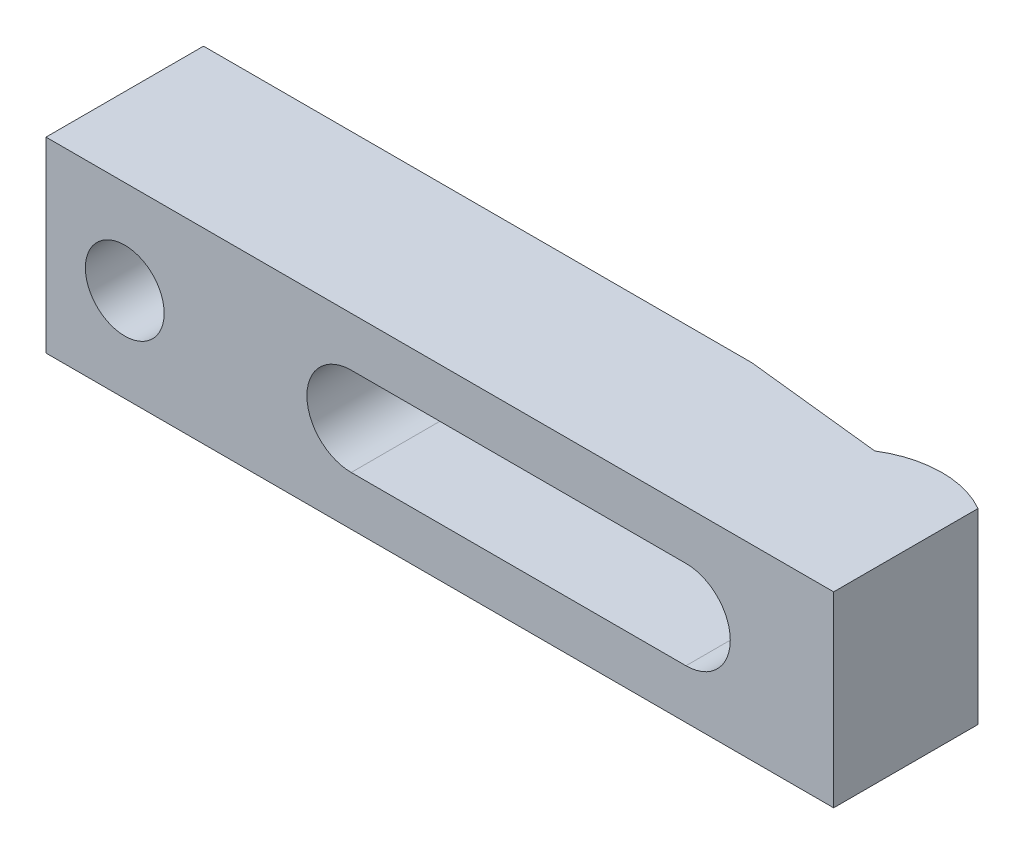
ISO-10303-21;
HEADER;
FILE_DESCRIPTION(('STEP AP214'),'2;1');
FILE_NAME('part.step','',(''),(''),'','','');
FILE_SCHEMA(('AUTOMOTIVE_DESIGN { 1 0 10303 214 1 1 1 1 }'));
ENDSEC;
DATA;
#1=APPLICATION_CONTEXT('core data for automotive mechanical design processes');
#2=APPLICATION_PROTOCOL_DEFINITION('international standard','automotive_design',2000,#1);
#3=PRODUCT_CONTEXT('',#1,'mechanical');
#4=PRODUCT('Part','Part','',(#3));
#5=PRODUCT_RELATED_PRODUCT_CATEGORY('part','',(#4));
#6=PRODUCT_DEFINITION_FORMATION('','',#4);
#7=PRODUCT_DEFINITION_CONTEXT('part definition',#1,'design');
#8=PRODUCT_DEFINITION('design','',#6,#7);
#9=PRODUCT_DEFINITION_SHAPE('','',#8);
#10=(LENGTH_UNIT() NAMED_UNIT(*) SI_UNIT(.MILLI.,.METRE.));
#11=(NAMED_UNIT(*) PLANE_ANGLE_UNIT() SI_UNIT($,.RADIAN.));
#12=(NAMED_UNIT(*) SI_UNIT($,.STERADIAN.) SOLID_ANGLE_UNIT());
#13=UNCERTAINTY_MEASURE_WITH_UNIT(LENGTH_MEASURE(1.E-05),#10,'distance_accuracy_value','');
#14=(GEOMETRIC_REPRESENTATION_CONTEXT(3) GLOBAL_UNCERTAINTY_ASSIGNED_CONTEXT((#13)) GLOBAL_UNIT_ASSIGNED_CONTEXT((#10,
#11,#12)) REPRESENTATION_CONTEXT('',''));
#15=CARTESIAN_POINT('',(0.,0.,0.));
#16=DIRECTION('',(0.,0.,1.));
#17=DIRECTION('',(1.,0.,0.));
#18=AXIS2_PLACEMENT_3D('',#15,#16,#17);
#19=CARTESIAN_POINT('',(-65.,9.5,0.));
#20=DIRECTION('',(0.,0.,-1.));
#21=DIRECTION('',(-1.,0.,0.));
#22=AXIS2_PLACEMENT_3D('',#19,#20,#21);
#23=PLANE('',#22);
#24=DIRECTION('',(1.,0.,0.));
#25=VECTOR('',#24,1.);
#26=CARTESIAN_POINT('',(-34.,4.5,0.));
#27=LINE('',#26,#25);
#28=CARTESIAN_POINT('',(-65.,4.5,0.));
#29=VERTEX_POINT('',#28);
#30=CARTESIAN_POINT('',(-9.3,4.5,0.));
#31=VERTEX_POINT('',#30);
#32=EDGE_CURVE('E122',#29,#31,#27,.T.);
#33=ORIENTED_EDGE('',*,*,#32,.F.);
#34=DIRECTION('',(0.,-1.,0.));
#35=VECTOR('',#34,1.);
#36=CARTESIAN_POINT('',(-65.,9.5,0.));
#37=LINE('',#36,#35);
#38=CARTESIAN_POINT('',(-65.,9.5,0.));
#39=VERTEX_POINT('',#38);
#40=EDGE_CURVE('E139',#39,#29,#37,.T.);
#41=ORIENTED_EDGE('',*,*,#40,.F.);
#42=DIRECTION('',(1.,0.,0.));
#43=VECTOR('',#42,1.);
#44=CARTESIAN_POINT('',(-65.,9.5,0.));
#45=LINE('',#44,#43);
#46=CARTESIAN_POINT('',(-9.3,9.5,0.));
#47=VERTEX_POINT('',#46);
#48=EDGE_CURVE('E196',#39,#47,#45,.T.);
#49=ORIENTED_EDGE('',*,*,#48,.T.);
#50=DIRECTION('',(0.,-1.,0.));
#51=VECTOR('',#50,1.);
#52=CARTESIAN_POINT('',(-9.3,9.5,0.));
#53=LINE('',#52,#51);
#54=EDGE_CURVE('E147',#47,#31,#53,.T.);
#55=ORIENTED_EDGE('',*,*,#54,.T.);
#56=EDGE_LOOP('',(#33,#41,#49,#55));
#57=FACE_BOUND('',#56,.T.);
#58=ADVANCED_FACE('F14',(#57),#23,.T.);
#59=CARTESIAN_POINT('',(-65.,9.5,16.));
#60=DIRECTION('',(-1.,0.,0.));
#61=DIRECTION('',(0.,0.,1.));
#62=AXIS2_PLACEMENT_3D('',#59,#60,#61);
#63=PLANE('',#62);
#64=ORIENTED_EDGE('',*,*,#40,.T.);
#65=DIRECTION('',(0.,0.,1.));
#66=VECTOR('',#65,1.);
#67=CARTESIAN_POINT('',(-65.,4.5,16.));
#68=LINE('',#67,#66);
#69=CARTESIAN_POINT('',(-65.,4.5,5.));
#70=VERTEX_POINT('',#69);
#71=EDGE_CURVE('E133',#29,#70,#68,.T.);
#72=ORIENTED_EDGE('',*,*,#71,.T.);
#73=DIRECTION('',(0.,-1.,0.));
#74=VECTOR('',#73,1.);
#75=CARTESIAN_POINT('',(-65.,9.5,5.));
#76=LINE('',#75,#74);
#77=CARTESIAN_POINT('',(-65.,-4.5,5.));
#78=VERTEX_POINT('',#77);
#79=EDGE_CURVE('E132',#70,#78,#76,.T.);
#80=ORIENTED_EDGE('',*,*,#79,.T.);
#81=DIRECTION('',(0.,0.,1.));
#82=VECTOR('',#81,1.);
#83=CARTESIAN_POINT('',(-65.,-4.5,16.));
#84=LINE('',#83,#82);
#85=CARTESIAN_POINT('',(-65.,-4.5,0.));
#86=VERTEX_POINT('',#85);
#87=EDGE_CURVE('E115',#86,#78,#84,.T.);
#88=ORIENTED_EDGE('',*,*,#87,.F.);
#89=CARTESIAN_POINT('',(-65.,-9.5,0.));
#90=VERTEX_POINT('',#89);
#91=EDGE_CURVE('E129',#86,#90,#37,.T.);
#92=ORIENTED_EDGE('',*,*,#91,.T.);
#93=DIRECTION('',(0.,0.,-1.));
#94=VECTOR('',#93,1.);
#95=CARTESIAN_POINT('',(-65.,-9.5,16.));
#96=LINE('',#95,#94);
#97=CARTESIAN_POINT('',(-65.,-9.5,16.));
#98=VERTEX_POINT('',#97);
#99=EDGE_CURVE('E169',#98,#90,#96,.T.);
#100=ORIENTED_EDGE('',*,*,#99,.F.);
#101=DIRECTION('',(0.,-1.,0.));
#102=VECTOR('',#101,1.);
#103=CARTESIAN_POINT('',(-65.,9.5,16.));
#104=LINE('',#103,#102);
#105=CARTESIAN_POINT('',(-65.,9.5,16.));
#106=VERTEX_POINT('',#105);
#107=EDGE_CURVE('E140',#106,#98,#104,.T.);
#108=ORIENTED_EDGE('',*,*,#107,.F.);
#109=DIRECTION('',(0.,0.,-1.));
#110=VECTOR('',#109,1.);
#111=CARTESIAN_POINT('',(-65.,9.5,16.));
#112=LINE('',#111,#110);
#113=EDGE_CURVE('E179',#106,#39,#112,.T.);
#114=ORIENTED_EDGE('',*,*,#113,.T.);
#115=EDGE_LOOP('',(#64,#72,#80,#88,#92,#100,#108,#114));
#116=FACE_BOUND('',#115,.T.);
#117=ADVANCED_FACE('F127',(#116),#63,.T.);
#118=CARTESIAN_POINT('',(-34.,0.,16.));
#119=DIRECTION('',(0.,0.,-1.));
#120=DIRECTION('',(-1.,0.,0.));
#121=AXIS2_PLACEMENT_3D('',#118,#119,#120);
#122=CYLINDRICAL_SURFACE('',#121,4.5);
#123=DIRECTION('',(0.,0.,-1.));
#124=VECTOR('',#123,1.);
#125=CARTESIAN_POINT('',(-34.,-4.5,16.));
#126=LINE('',#125,#124);
#127=CARTESIAN_POINT('',(-34.,-4.5,16.));
#128=VERTEX_POINT('',#127);
#129=CARTESIAN_POINT('',(-34.,-4.5,5.));
#130=VERTEX_POINT('',#129);
#131=EDGE_CURVE('E229',#128,#130,#126,.T.);
#132=ORIENTED_EDGE('',*,*,#131,.T.);
#133=CARTESIAN_POINT('',(-34.,0.,5.));
#134=DIRECTION('',(0.,0.,-1.));
#135=DIRECTION('',(-1.,0.,0.));
#136=AXIS2_PLACEMENT_3D('',#133,#134,#135);
#137=CIRCLE('',#136,4.5);
#138=CARTESIAN_POINT('',(-34.,4.5,5.));
#139=VERTEX_POINT('',#138);
#140=EDGE_CURVE('E245',#130,#139,#137,.T.);
#141=ORIENTED_EDGE('',*,*,#140,.T.);
#142=DIRECTION('',(0.,0.,-1.));
#143=VECTOR('',#142,1.);
#144=CARTESIAN_POINT('',(-34.,4.5,16.));
#145=LINE('',#144,#143);
#146=CARTESIAN_POINT('',(-34.,4.5,16.));
#147=VERTEX_POINT('',#146);
#148=EDGE_CURVE('E231',#147,#139,#145,.T.);
#149=ORIENTED_EDGE('',*,*,#148,.F.);
#150=CARTESIAN_POINT('',(-34.,0.,16.));
#151=DIRECTION('',(0.,0.,1.));
#152=DIRECTION('',(1.,0.,0.));
#153=AXIS2_PLACEMENT_3D('',#150,#151,#152);
#154=CIRCLE('',#153,4.5);
#155=EDGE_CURVE('E38',#147,#128,#154,.T.);
#156=ORIENTED_EDGE('',*,*,#155,.T.);
#157=EDGE_LOOP('',(#132,#141,#149,#156));
#158=FACE_BOUND('',#157,.T.);
#159=ADVANCED_FACE('F244',(#158),#122,.F.);
#160=CARTESIAN_POINT('',(-57.,0.,16.));
#161=DIRECTION('',(0.,0.,-1.));
#162=DIRECTION('',(-1.,0.,0.));
#163=AXIS2_PLACEMENT_3D('',#160,#161,#162);
#164=CYLINDRICAL_SURFACE('',#163,4.);
#165=CARTESIAN_POINT('',(-57.,0.,16.));
#166=DIRECTION('',(0.,0.,1.));
#167=DIRECTION('',(1.,0.,0.));
#168=AXIS2_PLACEMENT_3D('',#165,#166,#167);
#169=CIRCLE('',#168,4.);
#170=CARTESIAN_POINT('',(-53.,0.,16.));
#171=VERTEX_POINT('',#170);
#172=EDGE_CURVE('E209',#171,#171,#169,.T.);
#173=ORIENTED_EDGE('',*,*,#172,.T.);
#174=EDGE_LOOP('',(#173));
#175=FACE_BOUND('',#174,.T.);
#176=CARTESIAN_POINT('',(-57.,0.,5.));
#177=DIRECTION('',(0.,0.,-1.));
#178=DIRECTION('',(-1.,0.,0.));
#179=AXIS2_PLACEMENT_3D('',#176,#177,#178);
#180=CIRCLE('',#179,4.);
#181=CARTESIAN_POINT('',(-61.,0.,5.));
#182=VERTEX_POINT('',#181);
#183=EDGE_CURVE('E18',#182,#182,#180,.T.);
#184=ORIENTED_EDGE('',*,*,#183,.T.);
#185=EDGE_LOOP('',(#184));
#186=FACE_BOUND('',#185,.T.);
#187=ADVANCED_FACE('F275',(#175,#186),#164,.F.);
#188=CARTESIAN_POINT('',(15.,9.5,16.));
#189=DIRECTION('',(0.,0.,1.));
#190=DIRECTION('',(1.,0.,0.));
#191=AXIS2_PLACEMENT_3D('',#188,#189,#190);
#192=PLANE('',#191);
#193=DIRECTION('',(1.,0.,0.));
#194=VECTOR('',#193,1.);
#195=CARTESIAN_POINT('',(-34.,4.5,16.));
#196=LINE('',#195,#194);
#197=CARTESIAN_POINT('',(0.,4.5,16.));
#198=VERTEX_POINT('',#197);
#199=EDGE_CURVE('E223',#147,#198,#196,.T.);
#200=ORIENTED_EDGE('',*,*,#199,.T.);
#201=CARTESIAN_POINT('',(0.,0.,16.));
#202=DIRECTION('',(0.,0.,1.));
#203=DIRECTION('',(1.,0.,0.));
#204=AXIS2_PLACEMENT_3D('',#201,#202,#203);
#205=CIRCLE('',#204,4.5);
#206=CARTESIAN_POINT('',(0.,-4.5,16.));
#207=VERTEX_POINT('',#206);
#208=EDGE_CURVE('E121',#207,#198,#205,.T.);
#209=ORIENTED_EDGE('',*,*,#208,.F.);
#210=DIRECTION('',(-1.,0.,0.));
#211=VECTOR('',#210,1.);
#212=CARTESIAN_POINT('',(0.,-4.5,16.));
#213=LINE('',#212,#211);
#214=EDGE_CURVE('E218',#207,#128,#213,.T.);
#215=ORIENTED_EDGE('',*,*,#214,.T.);
#216=ORIENTED_EDGE('',*,*,#155,.F.);
#217=EDGE_LOOP('',(#200,#209,#215,#216));
#218=FACE_BOUND('',#217,.T.);
#219=DIRECTION('',(0.,-1.,0.));
#220=VECTOR('',#219,1.);
#221=CARTESIAN_POINT('',(15.,9.5,16.));
#222=LINE('',#221,#220);
#223=CARTESIAN_POINT('',(15.,9.5,16.));
#224=VERTEX_POINT('',#223);
#225=CARTESIAN_POINT('',(15.,-9.5,16.));
#226=VERTEX_POINT('',#225);
#227=EDGE_CURVE('E23',#224,#226,#222,.T.);
#228=ORIENTED_EDGE('',*,*,#227,.F.);
#229=DIRECTION('',(-1.,0.,0.));
#230=VECTOR('',#229,1.);
#231=CARTESIAN_POINT('',(15.,9.5,16.));
#232=LINE('',#231,#230);
#233=EDGE_CURVE('E177',#224,#106,#232,.T.);
#234=ORIENTED_EDGE('',*,*,#233,.T.);
#235=ORIENTED_EDGE('',*,*,#107,.T.);
#236=DIRECTION('',(-1.,0.,0.));
#237=VECTOR('',#236,1.);
#238=CARTESIAN_POINT('',(15.,-9.5,16.));
#239=LINE('',#238,#237);
#240=EDGE_CURVE('E165',#226,#98,#239,.T.);
#241=ORIENTED_EDGE('',*,*,#240,.F.);
#242=EDGE_LOOP('',(#228,#234,#235,#241));
#243=FACE_BOUND('',#242,.T.);
#244=ORIENTED_EDGE('',*,*,#172,.F.);
#245=EDGE_LOOP('',(#244));
#246=FACE_BOUND('',#245,.T.);
#247=ADVANCED_FACE('F166',(#218,#243,#246),#192,.T.);
#248=ORIENTED_EDGE('',*,*,#91,.F.);
#249=DIRECTION('',(-1.,0.,0.));
#250=VECTOR('',#249,1.);
#251=CARTESIAN_POINT('',(0.,-4.5,0.));
#252=LINE('',#251,#250);
#253=CARTESIAN_POINT('',(-9.3,-4.5,0.));
#254=VERTEX_POINT('',#253);
#255=EDGE_CURVE('E110',#254,#86,#252,.T.);
#256=ORIENTED_EDGE('',*,*,#255,.F.);
#257=CARTESIAN_POINT('',(-9.3,-9.5,0.));
#258=VERTEX_POINT('',#257);
#259=EDGE_CURVE('E142',#254,#258,#53,.T.);
#260=ORIENTED_EDGE('',*,*,#259,.T.);
#261=DIRECTION('',(1.,0.,0.));
#262=VECTOR('',#261,1.);
#263=CARTESIAN_POINT('',(-65.,-9.5,0.));
#264=LINE('',#263,#262);
#265=EDGE_CURVE('E138',#90,#258,#264,.T.);
#266=ORIENTED_EDGE('',*,*,#265,.F.);
#267=EDGE_LOOP('',(#248,#256,#260,#266));
#268=FACE_BOUND('',#267,.T.);
#269=ADVANCED_FACE('F136',(#268),#23,.T.);
#270=CARTESIAN_POINT('',(15.,9.5,16.));
#271=DIRECTION('',(-1.,0.,0.));
#272=DIRECTION('',(0.,0.,1.));
#273=AXIS2_PLACEMENT_3D('',#270,#271,#272);
#274=PLANE('',#273);
#275=DIRECTION('',(0.,-1.,0.));
#276=VECTOR('',#275,1.);
#277=CARTESIAN_POINT('',(15.,9.5,1.33974596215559));
#278=LINE('',#277,#276);
#279=CARTESIAN_POINT('',(15.,9.5,1.33974596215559));
#280=VERTEX_POINT('',#279);
#281=CARTESIAN_POINT('',(15.,-9.5,1.33974596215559));
#282=VERTEX_POINT('',#281);
#283=EDGE_CURVE('E152',#280,#282,#278,.T.);
#284=ORIENTED_EDGE('',*,*,#283,.F.);
#285=DIRECTION('',(0.,0.,-1.));
#286=VECTOR('',#285,1.);
#287=CARTESIAN_POINT('',(15.,9.5,16.));
#288=LINE('',#287,#286);
#289=EDGE_CURVE('E143',#224,#280,#288,.T.);
#290=ORIENTED_EDGE('',*,*,#289,.F.);
#291=ORIENTED_EDGE('',*,*,#227,.T.);
#292=DIRECTION('',(0.,0.,-1.));
#293=VECTOR('',#292,1.);
#294=CARTESIAN_POINT('',(15.,-9.5,16.));
#295=LINE('',#294,#293);
#296=EDGE_CURVE('E159',#226,#282,#295,.T.);
#297=ORIENTED_EDGE('',*,*,#296,.T.);
#298=EDGE_LOOP('',(#284,#290,#291,#297));
#299=FACE_BOUND('',#298,.T.);
#300=ADVANCED_FACE('F16',(#299),#274,.F.);
#301=CARTESIAN_POINT('',(10.,9.5,10.));
#302=DIRECTION('',(0.,-1.,0.));
#303=DIRECTION('',(0.,0.,-1.));
#304=AXIS2_PLACEMENT_3D('',#301,#302,#303);
#305=CYLINDRICAL_SURFACE('',#304,10.);
#306=DIRECTION('',(0.,-1.,0.));
#307=VECTOR('',#306,1.);
#308=CARTESIAN_POINT('',(4.7,9.5,1.52002358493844));
#309=LINE('',#308,#307);
#310=CARTESIAN_POINT('',(4.7,9.5,1.52002358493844));
#311=VERTEX_POINT('',#310);
#312=CARTESIAN_POINT('',(4.7,-9.5,1.52002358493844));
#313=VERTEX_POINT('',#312);
#314=EDGE_CURVE('E150',#311,#313,#309,.T.);
#315=ORIENTED_EDGE('',*,*,#314,.F.);
#316=CARTESIAN_POINT('',(10.,9.5,10.));
#317=DIRECTION('',(0.,1.,0.));
#318=DIRECTION('',(0.,0.,1.));
#319=AXIS2_PLACEMENT_3D('',#316,#317,#318);
#320=CIRCLE('',#319,10.);
#321=EDGE_CURVE('E190',#280,#311,#320,.T.);
#322=ORIENTED_EDGE('',*,*,#321,.F.);
#323=ORIENTED_EDGE('',*,*,#283,.T.);
#324=CARTESIAN_POINT('',(10.,-9.5,10.));
#325=DIRECTION('',(0.,1.,0.));
#326=DIRECTION('',(0.,0.,1.));
#327=AXIS2_PLACEMENT_3D('',#324,#325,#326);
#328=CIRCLE('',#327,10.);
#329=EDGE_CURVE('E176',#282,#313,#328,.T.);
#330=ORIENTED_EDGE('',*,*,#329,.T.);
#331=EDGE_LOOP('',(#315,#322,#323,#330));
#332=FACE_BOUND('',#331,.T.);
#333=ADVANCED_FACE('F274',(#332),#305,.T.);
#334=CARTESIAN_POINT('',(4.7,9.5,1.52002358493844));
#335=DIRECTION('',(-0.107938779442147,0.,0.994157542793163));
#336=DIRECTION('',(0.994157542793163,0.,0.107938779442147));
#337=AXIS2_PLACEMENT_3D('',#334,#335,#336);
#338=PLANE('',#337);
#339=CARTESIAN_POINT('',(0.,0.,1.00972995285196));
#340=DIRECTION('',(-0.107938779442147,0.,0.994157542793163));
#341=DIRECTION('',(-0.994157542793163,0.,-0.107938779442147));
#342=AXIS2_PLACEMENT_3D('',#339,#340,#341);
#343=ELLIPSE('',#342,4.52644556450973,4.5);
#344=CARTESIAN_POINT('',(0.,4.5,1.00972995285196));
#345=VERTEX_POINT('',#344);
#346=CARTESIAN_POINT('',(0.,-4.5,1.00972995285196));
#347=VERTEX_POINT('',#346);
#348=EDGE_CURVE('E9',#345,#347,#343,.F.);
#349=ORIENTED_EDGE('',*,*,#348,.F.);
#350=DIRECTION('',(-0.994157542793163,0.,-0.107938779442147));
#351=VECTOR('',#350,1.);
#352=CARTESIAN_POINT('',(4.7,4.5,1.52002358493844));
#353=LINE('',#352,#351);
#354=EDGE_CURVE('E170',#345,#31,#353,.T.);
#355=ORIENTED_EDGE('',*,*,#354,.T.);
#356=ORIENTED_EDGE('',*,*,#54,.F.);
#357=DIRECTION('',(-0.994157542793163,0.,-0.107938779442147));
#358=VECTOR('',#357,1.);
#359=CARTESIAN_POINT('',(4.7,9.5,1.52002358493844));
#360=LINE('',#359,#358);
#361=EDGE_CURVE('E193',#311,#47,#360,.T.);
#362=ORIENTED_EDGE('',*,*,#361,.F.);
#363=ORIENTED_EDGE('',*,*,#314,.T.);
#364=DIRECTION('',(-0.994157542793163,0.,-0.107938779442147));
#365=VECTOR('',#364,1.);
#366=CARTESIAN_POINT('',(4.7,-9.5,1.52002358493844));
#367=LINE('',#366,#365);
#368=EDGE_CURVE('E180',#313,#258,#367,.T.);
#369=ORIENTED_EDGE('',*,*,#368,.T.);
#370=ORIENTED_EDGE('',*,*,#259,.F.);
#371=DIRECTION('',(0.994157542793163,0.,0.107938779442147));
#372=VECTOR('',#371,1.);
#373=CARTESIAN_POINT('',(4.7,-4.5,1.52002358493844));
#374=LINE('',#373,#372);
#375=EDGE_CURVE('E117',#254,#347,#374,.T.);
#376=ORIENTED_EDGE('',*,*,#375,.T.);
#377=EDGE_LOOP('',(#349,#355,#356,#362,#363,#369,#370,#376));
#378=FACE_BOUND('',#377,.T.);
#379=ADVANCED_FACE('F237',(#378),#338,.F.);
#380=CARTESIAN_POINT('',(10.,9.5,10.));
#381=DIRECTION('',(0.,1.,0.));
#382=DIRECTION('',(0.,0.,1.));
#383=AXIS2_PLACEMENT_3D('',#380,#381,#382);
#384=PLANE('',#383);
#385=ORIENTED_EDGE('',*,*,#233,.F.);
#386=ORIENTED_EDGE('',*,*,#289,.T.);
#387=ORIENTED_EDGE('',*,*,#321,.T.);
#388=ORIENTED_EDGE('',*,*,#361,.T.);
#389=ORIENTED_EDGE('',*,*,#48,.F.);
#390=ORIENTED_EDGE('',*,*,#113,.F.);
#391=EDGE_LOOP('',(#385,#386,#387,#388,#389,#390));
#392=FACE_BOUND('',#391,.T.);
#393=ADVANCED_FACE('F203',(#392),#384,.T.);
#394=CARTESIAN_POINT('',(10.,-9.5,10.));
#395=DIRECTION('',(0.,1.,0.));
#396=DIRECTION('',(0.,0.,1.));
#397=AXIS2_PLACEMENT_3D('',#394,#395,#396);
#398=PLANE('',#397);
#399=ORIENTED_EDGE('',*,*,#240,.T.);
#400=ORIENTED_EDGE('',*,*,#99,.T.);
#401=ORIENTED_EDGE('',*,*,#265,.T.);
#402=ORIENTED_EDGE('',*,*,#368,.F.);
#403=ORIENTED_EDGE('',*,*,#329,.F.);
#404=ORIENTED_EDGE('',*,*,#296,.F.);
#405=EDGE_LOOP('',(#399,#400,#401,#402,#403,#404));
#406=FACE_BOUND('',#405,.T.);
#407=ADVANCED_FACE('F173',(#406),#398,.F.);
#408=CARTESIAN_POINT('',(0.,0.,16.));
#409=DIRECTION('',(0.,0.,-1.));
#410=DIRECTION('',(-1.,0.,0.));
#411=AXIS2_PLACEMENT_3D('',#408,#409,#410);
#412=CYLINDRICAL_SURFACE('',#411,4.5);
#413=ORIENTED_EDGE('',*,*,#348,.T.);
#414=DIRECTION('',(0.,0.,-1.));
#415=VECTOR('',#414,1.);
#416=CARTESIAN_POINT('',(0.,-4.5,16.));
#417=LINE('',#416,#415);
#418=EDGE_CURVE('E221',#207,#347,#417,.T.);
#419=ORIENTED_EDGE('',*,*,#418,.F.);
#420=ORIENTED_EDGE('',*,*,#208,.T.);
#421=DIRECTION('',(0.,0.,-1.));
#422=VECTOR('',#421,1.);
#423=CARTESIAN_POINT('',(0.,4.5,16.));
#424=LINE('',#423,#422);
#425=EDGE_CURVE('E233',#198,#345,#424,.T.);
#426=ORIENTED_EDGE('',*,*,#425,.T.);
#427=EDGE_LOOP('',(#413,#419,#420,#426));
#428=FACE_BOUND('',#427,.T.);
#429=ADVANCED_FACE('F240',(#428),#412,.F.);
#430=CARTESIAN_POINT('',(-34.,4.5,16.));
#431=DIRECTION('',(0.,1.,0.));
#432=DIRECTION('',(-1.,0.,0.));
#433=AXIS2_PLACEMENT_3D('',#430,#431,#432);
#434=PLANE('',#433);
#435=ORIENTED_EDGE('',*,*,#32,.T.);
#436=ORIENTED_EDGE('',*,*,#354,.F.);
#437=ORIENTED_EDGE('',*,*,#425,.F.);
#438=ORIENTED_EDGE('',*,*,#199,.F.);
#439=ORIENTED_EDGE('',*,*,#148,.T.);
#440=DIRECTION('',(-1.,0.,0.));
#441=VECTOR('',#440,1.);
#442=CARTESIAN_POINT('',(-5.,4.5,5.));
#443=LINE('',#442,#441);
#444=EDGE_CURVE('E30',#139,#70,#443,.T.);
#445=ORIENTED_EDGE('',*,*,#444,.T.);
#446=ORIENTED_EDGE('',*,*,#71,.F.);
#447=EDGE_LOOP('',(#435,#436,#437,#438,#439,#445,#446));
#448=FACE_BOUND('',#447,.T.);
#449=ADVANCED_FACE('F211',(#448),#434,.F.);
#450=CARTESIAN_POINT('',(0.,-4.5,16.));
#451=DIRECTION('',(0.,-1.,0.));
#452=DIRECTION('',(1.,0.,0.));
#453=AXIS2_PLACEMENT_3D('',#450,#451,#452);
#454=PLANE('',#453);
#455=ORIENTED_EDGE('',*,*,#418,.T.);
#456=ORIENTED_EDGE('',*,*,#375,.F.);
#457=ORIENTED_EDGE('',*,*,#255,.T.);
#458=ORIENTED_EDGE('',*,*,#87,.T.);
#459=DIRECTION('',(-1.,0.,0.));
#460=VECTOR('',#459,1.);
#461=CARTESIAN_POINT('',(-5.,-4.5,5.));
#462=LINE('',#461,#460);
#463=EDGE_CURVE('E249',#130,#78,#462,.T.);
#464=ORIENTED_EDGE('',*,*,#463,.F.);
#465=ORIENTED_EDGE('',*,*,#131,.F.);
#466=ORIENTED_EDGE('',*,*,#214,.F.);
#467=EDGE_LOOP('',(#455,#456,#457,#458,#464,#465,#466));
#468=FACE_BOUND('',#467,.T.);
#469=ADVANCED_FACE('F113',(#468),#454,.F.);
#470=CARTESIAN_POINT('',(-5.,-4.5,5.));
#471=DIRECTION('',(0.,0.,-1.));
#472=DIRECTION('',(-1.,0.,0.));
#473=AXIS2_PLACEMENT_3D('',#470,#471,#472);
#474=PLANE('',#473);
#475=ORIENTED_EDGE('',*,*,#183,.F.);
#476=EDGE_LOOP('',(#475));
#477=FACE_BOUND('',#476,.T.);
#478=ORIENTED_EDGE('',*,*,#444,.F.);
#479=ORIENTED_EDGE('',*,*,#140,.F.);
#480=ORIENTED_EDGE('',*,*,#463,.T.);
#481=ORIENTED_EDGE('',*,*,#79,.F.);
#482=EDGE_LOOP('',(#478,#479,#480,#481));
#483=FACE_BOUND('',#482,.T.);
#484=ADVANCED_FACE('F251',(#477,#483),#474,.T.);
#485=CLOSED_SHELL('',(#58,#117,#159,#187,#247,#269,#300,#333,#379,#393,#407,#429,#449,#469,#484));
#486=MANIFOLD_SOLID_BREP('B1',#485);
#487=ADVANCED_BREP_SHAPE_REPRESENTATION('',(#18,#486),#14);
#488=SHAPE_DEFINITION_REPRESENTATION(#9,#487);
ENDSEC;
END-ISO-10303-21;
